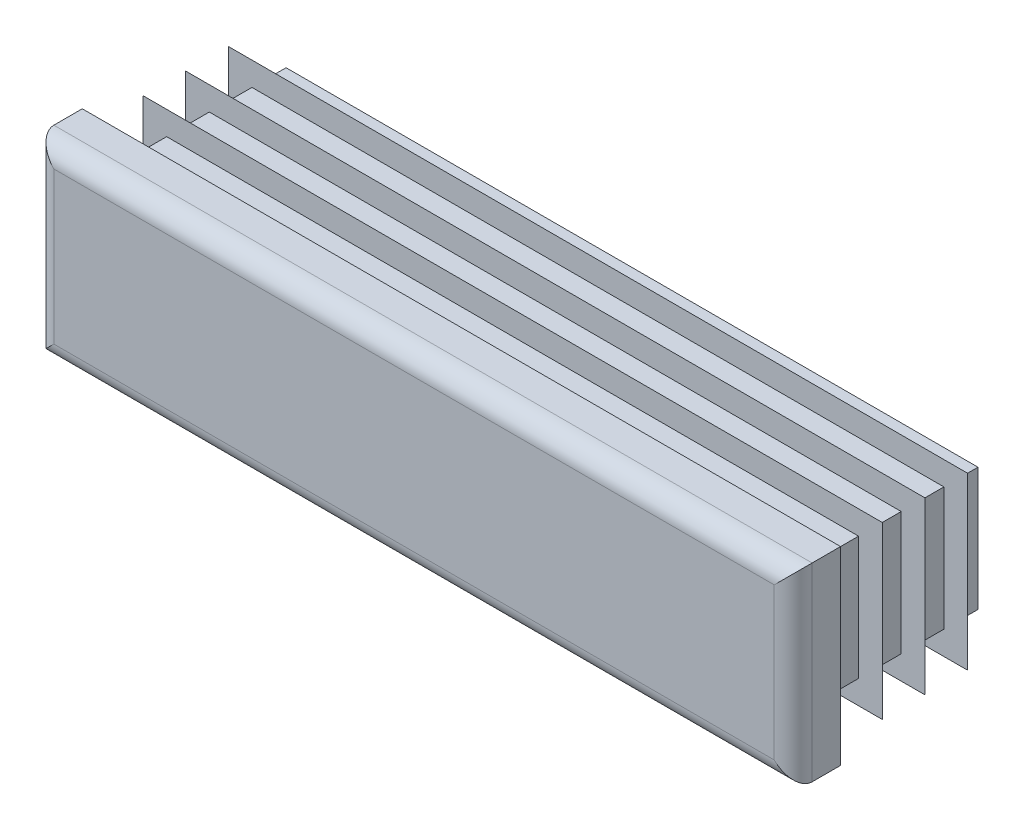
ISO-10303-21;
HEADER;
FILE_DESCRIPTION(('STEP AP214'),'2;1');
FILE_NAME('part.step','',(''),(''),'','','');
FILE_SCHEMA(('AUTOMOTIVE_DESIGN { 1 0 10303 214 1 1 1 1 }'));
ENDSEC;
DATA;
#1=APPLICATION_CONTEXT('core data for automotive mechanical design processes');
#2=APPLICATION_PROTOCOL_DEFINITION('international standard','automotive_design',2000,#1);
#3=PRODUCT_CONTEXT('',#1,'mechanical');
#4=PRODUCT('Part','Part','',(#3));
#5=PRODUCT_RELATED_PRODUCT_CATEGORY('part','',(#4));
#6=PRODUCT_DEFINITION_FORMATION('','',#4);
#7=PRODUCT_DEFINITION_CONTEXT('part definition',#1,'design');
#8=PRODUCT_DEFINITION('design','',#6,#7);
#9=PRODUCT_DEFINITION_SHAPE('','',#8);
#10=(LENGTH_UNIT() NAMED_UNIT(*) SI_UNIT(.MILLI.,.METRE.));
#11=(NAMED_UNIT(*) PLANE_ANGLE_UNIT() SI_UNIT($,.RADIAN.));
#12=(NAMED_UNIT(*) SI_UNIT($,.STERADIAN.) SOLID_ANGLE_UNIT());
#13=UNCERTAINTY_MEASURE_WITH_UNIT(LENGTH_MEASURE(1.E-05),#10,'distance_accuracy_value','');
#14=(GEOMETRIC_REPRESENTATION_CONTEXT(3) GLOBAL_UNCERTAINTY_ASSIGNED_CONTEXT((#13)) GLOBAL_UNIT_ASSIGNED_CONTEXT((#10,
#11,#12)) REPRESENTATION_CONTEXT('',''));
#15=CARTESIAN_POINT('',(0.,0.,0.));
#16=DIRECTION('',(0.,0.,1.));
#17=DIRECTION('',(1.,0.,0.));
#18=AXIS2_PLACEMENT_3D('',#15,#16,#17);
#19=CARTESIAN_POINT('',(38.,-10.,5.));
#20=DIRECTION('',(0.,0.,-1.));
#21=DIRECTION('',(0.,1.,0.));
#22=AXIS2_PLACEMENT_3D('',#19,#20,#21);
#23=PLANE('',#22);
#24=DIRECTION('',(0.,1.,0.));
#25=VECTOR('',#24,1.);
#26=CARTESIAN_POINT('',(-38.,-10.,5.));
#27=LINE('',#26,#25);
#28=CARTESIAN_POINT('',(-38.,-8.,5.));
#29=VERTEX_POINT('',#28);
#30=CARTESIAN_POINT('',(-38.,8.,5.));
#31=VERTEX_POINT('',#30);
#32=EDGE_CURVE('E310',#29,#31,#27,.T.);
#33=ORIENTED_EDGE('',*,*,#32,.F.);
#34=DIRECTION('',(-1.,0.,0.));
#35=VECTOR('',#34,1.);
#36=CARTESIAN_POINT('',(40.,-8.,5.));
#37=LINE('',#36,#35);
#38=CARTESIAN_POINT('',(38.,-8.,5.));
#39=VERTEX_POINT('',#38);
#40=EDGE_CURVE('E482',#39,#29,#37,.T.);
#41=ORIENTED_EDGE('',*,*,#40,.F.);
#42=DIRECTION('',(0.,1.,0.));
#43=VECTOR('',#42,1.);
#44=CARTESIAN_POINT('',(38.,-10.,5.));
#45=LINE('',#44,#43);
#46=CARTESIAN_POINT('',(38.,8.,5.));
#47=VERTEX_POINT('',#46);
#48=EDGE_CURVE('E305',#39,#47,#45,.T.);
#49=ORIENTED_EDGE('',*,*,#48,.T.);
#50=DIRECTION('',(-1.,0.,0.));
#51=VECTOR('',#50,1.);
#52=CARTESIAN_POINT('',(40.,8.,5.));
#53=LINE('',#52,#51);
#54=EDGE_CURVE('E630',#47,#31,#53,.T.);
#55=ORIENTED_EDGE('',*,*,#54,.T.);
#56=EDGE_LOOP('',(#33,#41,#49,#55));
#57=FACE_BOUND('',#56,.T.);
#58=ADVANCED_FACE('F14',(#57),#23,.F.);
#59=CARTESIAN_POINT('',(-38.,-10.,3.));
#60=DIRECTION('',(0.,1.,0.));
#61=DIRECTION('',(-1.,0.,0.));
#62=AXIS2_PLACEMENT_3D('',#59,#60,#61);
#63=CYLINDRICAL_SURFACE('',#62,2.);
#64=DIRECTION('',(0.,1.,0.));
#65=VECTOR('',#64,1.);
#66=CARTESIAN_POINT('',(-40.,-10.,3.));
#67=LINE('',#66,#65);
#68=CARTESIAN_POINT('',(-40.,-10.,3.));
#69=VERTEX_POINT('',#68);
#70=CARTESIAN_POINT('',(-40.,10.,3.));
#71=VERTEX_POINT('',#70);
#72=EDGE_CURVE('E402',#69,#71,#67,.T.);
#73=ORIENTED_EDGE('',*,*,#72,.F.);
#74=CARTESIAN_POINT('',(-38.,-8.,3.));
#75=DIRECTION('',(-0.707106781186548,0.707106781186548,0.));
#76=DIRECTION('',(0.707106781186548,0.707106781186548,0.));
#77=AXIS2_PLACEMENT_3D('',#74,#75,#76);
#78=ELLIPSE('',#77,2.82842712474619,2.);
#79=EDGE_CURVE('E59',#69,#29,#78,.T.);
#80=ORIENTED_EDGE('',*,*,#79,.T.);
#81=ORIENTED_EDGE('',*,*,#32,.T.);
#82=CARTESIAN_POINT('',(-38.,8.,3.));
#83=DIRECTION('',(0.707106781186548,0.707106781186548,0.));
#84=DIRECTION('',(-0.707106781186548,0.707106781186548,0.));
#85=AXIS2_PLACEMENT_3D('',#82,#83,#84);
#86=ELLIPSE('',#85,2.82842712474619,2.);
#87=EDGE_CURVE('E306',#31,#71,#86,.F.);
#88=ORIENTED_EDGE('',*,*,#87,.T.);
#89=EDGE_LOOP('',(#73,#80,#81,#88));
#90=FACE_BOUND('',#89,.T.);
#91=ADVANCED_FACE('F16',(#90),#63,.T.);
#92=CARTESIAN_POINT('',(-40.,-10.,3.));
#93=DIRECTION('',(1.,0.,0.));
#94=DIRECTION('',(0.,1.,0.));
#95=AXIS2_PLACEMENT_3D('',#92,#93,#94);
#96=PLANE('',#95);
#97=DIRECTION('',(0.,0.,-1.));
#98=VECTOR('',#97,1.);
#99=CARTESIAN_POINT('',(-40.,10.,3.));
#100=LINE('',#99,#98);
#101=CARTESIAN_POINT('',(-40.,10.,0.));
#102=VERTEX_POINT('',#101);
#103=EDGE_CURVE('E615',#71,#102,#100,.T.);
#104=ORIENTED_EDGE('',*,*,#103,.T.);
#105=DIRECTION('',(0.,1.,0.));
#106=VECTOR('',#105,1.);
#107=CARTESIAN_POINT('',(-40.,-10.,0.));
#108=LINE('',#107,#106);
#109=CARTESIAN_POINT('',(-40.,-10.,0.));
#110=VERTEX_POINT('',#109);
#111=EDGE_CURVE('E400',#110,#102,#108,.T.);
#112=ORIENTED_EDGE('',*,*,#111,.F.);
#113=DIRECTION('',(0.,0.,-1.));
#114=VECTOR('',#113,1.);
#115=CARTESIAN_POINT('',(-40.,-10.,3.));
#116=LINE('',#115,#114);
#117=EDGE_CURVE('E616',#69,#110,#116,.T.);
#118=ORIENTED_EDGE('',*,*,#117,.F.);
#119=ORIENTED_EDGE('',*,*,#72,.T.);
#120=EDGE_LOOP('',(#104,#112,#118,#119));
#121=FACE_BOUND('',#120,.T.);
#122=ADVANCED_FACE('F697',(#121),#96,.F.);
#123=CARTESIAN_POINT('',(-36.5,-10.,0.));
#124=DIRECTION('',(1.,0.,0.));
#125=DIRECTION('',(0.,1.,0.));
#126=AXIS2_PLACEMENT_3D('',#123,#124,#125);
#127=PLANE('',#126);
#128=DIRECTION('',(0.,1.,0.));
#129=VECTOR('',#128,1.);
#130=CARTESIAN_POINT('',(-36.5,-10.,0.));
#131=LINE('',#130,#129);
#132=CARTESIAN_POINT('',(-36.5,-6.5,0.));
#133=VERTEX_POINT('',#132);
#134=CARTESIAN_POINT('',(-36.5,6.5,0.));
#135=VERTEX_POINT('',#134);
#136=EDGE_CURVE('E397',#133,#135,#131,.T.);
#137=ORIENTED_EDGE('',*,*,#136,.T.);
#138=DIRECTION('',(0.,0.,-1.));
#139=VECTOR('',#138,1.);
#140=CARTESIAN_POINT('',(-36.5,6.5,0.));
#141=LINE('',#140,#139);
#142=CARTESIAN_POINT('',(-36.5,6.5,-0.9));
#143=VERTEX_POINT('',#142);
#144=EDGE_CURVE('E495',#135,#143,#141,.T.);
#145=ORIENTED_EDGE('',*,*,#144,.T.);
#146=DIRECTION('',(0.,1.,0.));
#147=VECTOR('',#146,1.);
#148=CARTESIAN_POINT('',(-36.5,-10.,-0.9));
#149=LINE('',#148,#147);
#150=CARTESIAN_POINT('',(-36.5,-6.5,-0.9));
#151=VERTEX_POINT('',#150);
#152=EDGE_CURVE('E394',#151,#143,#149,.T.);
#153=ORIENTED_EDGE('',*,*,#152,.F.);
#154=DIRECTION('',(0.,0.,1.));
#155=VECTOR('',#154,1.);
#156=CARTESIAN_POINT('',(-36.5,-6.5,0.));
#157=LINE('',#156,#155);
#158=EDGE_CURVE('E489',#151,#133,#157,.T.);
#159=ORIENTED_EDGE('',*,*,#158,.T.);
#160=EDGE_LOOP('',(#137,#145,#153,#159));
#161=FACE_BOUND('',#160,.T.);
#162=ADVANCED_FACE('F787',(#161),#127,.F.);
#163=CARTESIAN_POINT('',(-39.,-10.,-0.9));
#164=DIRECTION('',(0.342020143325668,0.,0.939692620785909));
#165=DIRECTION('',(-0.939692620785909,0.,0.342020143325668));
#166=AXIS2_PLACEMENT_3D('',#163,#164,#165);
#167=PLANE('',#166);
#168=DIRECTION('',(0.,1.,0.));
#169=VECTOR('',#168,1.);
#170=CARTESIAN_POINT('',(-39.,-10.,-0.9));
#171=LINE('',#170,#169);
#172=CARTESIAN_POINT('',(-39.,-9.,-0.9));
#173=VERTEX_POINT('',#172);
#174=CARTESIAN_POINT('',(-39.,9.,-0.9));
#175=VERTEX_POINT('',#174);
#176=EDGE_CURVE('E392',#173,#175,#171,.T.);
#177=ORIENTED_EDGE('',*,*,#176,.T.);
#178=DIRECTION('',(0.844349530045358,-0.43889572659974,-0.307318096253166));
#179=VECTOR('',#178,1.);
#180=CARTESIAN_POINT('',(-31.9589533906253,5.34004028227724,-3.46273138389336));
#181=LINE('',#180,#179);
#182=CARTESIAN_POINT('',(-36.5,7.70049158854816,-1.8099255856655));
#183=VERTEX_POINT('',#182);
#184=EDGE_CURVE('E519',#175,#183,#181,.T.);
#185=ORIENTED_EDGE('',*,*,#184,.T.);
#186=DIRECTION('',(0.,1.,0.));
#187=VECTOR('',#186,1.);
#188=CARTESIAN_POINT('',(-36.5,-10.,-1.8099255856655));
#189=LINE('',#188,#187);
#190=CARTESIAN_POINT('',(-36.5,-7.70049158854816,-1.8099255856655));
#191=VERTEX_POINT('',#190);
#192=EDGE_CURVE('E389',#191,#183,#189,.T.);
#193=ORIENTED_EDGE('',*,*,#192,.F.);
#194=DIRECTION('',(-0.844349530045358,-0.43889572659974,0.307318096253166));
#195=VECTOR('',#194,1.);
#196=CARTESIAN_POINT('',(-39.3705814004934,-9.19262945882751,-0.765119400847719));
#197=LINE('',#196,#195);
#198=EDGE_CURVE('E507',#191,#173,#197,.T.);
#199=ORIENTED_EDGE('',*,*,#198,.T.);
#200=EDGE_LOOP('',(#177,#185,#193,#199));
#201=FACE_BOUND('',#200,.T.);
#202=ADVANCED_FACE('F783',(#201),#167,.F.);
#203=CARTESIAN_POINT('',(-36.5,-10.,-1.8099255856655));
#204=DIRECTION('',(1.,0.,0.));
#205=DIRECTION('',(0.,1.,0.));
#206=AXIS2_PLACEMENT_3D('',#203,#204,#205);
#207=PLANE('',#206);
#208=ORIENTED_EDGE('',*,*,#192,.T.);
#209=DIRECTION('',(0.,-0.819152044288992,-0.573576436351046));
#210=VECTOR('',#209,1.);
#211=CARTESIAN_POINT('',(-36.5,-4.17671654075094,-10.1264362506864));
#212=LINE('',#211,#210);
#213=CARTESIAN_POINT('',(-36.5,6.5,-2.65051884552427));
#214=VERTEX_POINT('',#213);
#215=EDGE_CURVE('E516',#183,#214,#212,.T.);
#216=ORIENTED_EDGE('',*,*,#215,.T.);
#217=DIRECTION('',(0.,0.,-1.));
#218=VECTOR('',#217,1.);
#219=CARTESIAN_POINT('',(-36.5,6.5,-1.8099255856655));
#220=LINE('',#219,#218);
#221=CARTESIAN_POINT('',(-36.5,6.5,-5.4));
#222=VERTEX_POINT('',#221);
#223=EDGE_CURVE('E525',#214,#222,#220,.T.);
#224=ORIENTED_EDGE('',*,*,#223,.T.);
#225=DIRECTION('',(0.,1.,0.));
#226=VECTOR('',#225,1.);
#227=CARTESIAN_POINT('',(-36.5,-10.,-5.4));
#228=LINE('',#227,#226);
#229=CARTESIAN_POINT('',(-36.5,-6.5,-5.4));
#230=VERTEX_POINT('',#229);
#231=EDGE_CURVE('E386',#230,#222,#228,.T.);
#232=ORIENTED_EDGE('',*,*,#231,.F.);
#233=DIRECTION('',(0.,0.,1.));
#234=VECTOR('',#233,1.);
#235=CARTESIAN_POINT('',(-36.5,-6.5,-1.8099255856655));
#236=LINE('',#235,#234);
#237=CARTESIAN_POINT('',(-36.5,-6.5,-2.65051884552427));
#238=VERTEX_POINT('',#237);
#239=EDGE_CURVE('E522',#230,#238,#236,.T.);
#240=ORIENTED_EDGE('',*,*,#239,.T.);
#241=DIRECTION('',(0.,-0.819152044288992,0.573576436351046));
#242=VECTOR('',#241,1.);
#243=CARTESIAN_POINT('',(-36.5,-9.24348489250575,-0.729510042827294));
#244=LINE('',#243,#242);
#245=EDGE_CURVE('E504',#238,#191,#244,.T.);
#246=ORIENTED_EDGE('',*,*,#245,.T.);
#247=EDGE_LOOP('',(#208,#216,#224,#232,#240,#246));
#248=FACE_BOUND('',#247,.T.);
#249=ADVANCED_FACE('F779',(#248),#207,.F.);
#250=CARTESIAN_POINT('',(-39.,-10.,-5.4));
#251=DIRECTION('',(0.342020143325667,0.,0.939692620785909));
#252=DIRECTION('',(-0.939692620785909,0.,0.342020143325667));
#253=AXIS2_PLACEMENT_3D('',#250,#251,#252);
#254=PLANE('',#253);
#255=DIRECTION('',(0.,1.,0.));
#256=VECTOR('',#255,1.);
#257=CARTESIAN_POINT('',(-39.,-10.,-5.4));
#258=LINE('',#257,#256);
#259=CARTESIAN_POINT('',(-39.,-9.,-5.4));
#260=VERTEX_POINT('',#259);
#261=CARTESIAN_POINT('',(-39.,9.,-5.4));
#262=VERTEX_POINT('',#261);
#263=EDGE_CURVE('E384',#260,#262,#258,.T.);
#264=ORIENTED_EDGE('',*,*,#263,.T.);
#265=DIRECTION('',(0.844349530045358,-0.43889572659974,-0.307318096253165));
#266=VECTOR('',#265,1.);
#267=CARTESIAN_POINT('',(-31.9589533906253,5.34004028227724,-7.96273138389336));
#268=LINE('',#267,#266);
#269=CARTESIAN_POINT('',(-36.5,7.70049158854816,-6.30992558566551));
#270=VERTEX_POINT('',#269);
#271=EDGE_CURVE('E549',#262,#270,#268,.T.);
#272=ORIENTED_EDGE('',*,*,#271,.T.);
#273=DIRECTION('',(0.,1.,0.));
#274=VECTOR('',#273,1.);
#275=CARTESIAN_POINT('',(-36.5,-10.,-6.3099255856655));
#276=LINE('',#275,#274);
#277=CARTESIAN_POINT('',(-36.5,-7.70049158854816,-6.3099255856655));
#278=VERTEX_POINT('',#277);
#279=EDGE_CURVE('E381',#278,#270,#276,.T.);
#280=ORIENTED_EDGE('',*,*,#279,.F.);
#281=DIRECTION('',(-0.844349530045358,-0.43889572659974,0.307318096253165));
#282=VECTOR('',#281,1.);
#283=CARTESIAN_POINT('',(-39.3705814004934,-9.19262945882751,-5.26511940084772));
#284=LINE('',#283,#282);
#285=EDGE_CURVE('E537',#278,#260,#284,.T.);
#286=ORIENTED_EDGE('',*,*,#285,.T.);
#287=EDGE_LOOP('',(#264,#272,#280,#286));
#288=FACE_BOUND('',#287,.T.);
#289=ADVANCED_FACE('F775',(#288),#254,.F.);
#290=CARTESIAN_POINT('',(-36.5,-10.,-6.3099255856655));
#291=DIRECTION('',(1.,0.,0.));
#292=DIRECTION('',(0.,1.,0.));
#293=AXIS2_PLACEMENT_3D('',#290,#291,#292);
#294=PLANE('',#293);
#295=ORIENTED_EDGE('',*,*,#279,.T.);
#296=DIRECTION('',(0.,-0.819152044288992,-0.573576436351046));
#297=VECTOR('',#296,1.);
#298=CARTESIAN_POINT('',(-36.5,-4.17671654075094,-14.6264362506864));
#299=LINE('',#298,#297);
#300=CARTESIAN_POINT('',(-36.5,6.5,-7.15051884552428));
#301=VERTEX_POINT('',#300);
#302=EDGE_CURVE('E546',#270,#301,#299,.T.);
#303=ORIENTED_EDGE('',*,*,#302,.T.);
#304=DIRECTION('',(0.,0.,-1.));
#305=VECTOR('',#304,1.);
#306=CARTESIAN_POINT('',(-36.5,6.5,-6.3099255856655));
#307=LINE('',#306,#305);
#308=CARTESIAN_POINT('',(-36.5,6.5,-9.9));
#309=VERTEX_POINT('',#308);
#310=EDGE_CURVE('E555',#301,#309,#307,.T.);
#311=ORIENTED_EDGE('',*,*,#310,.T.);
#312=DIRECTION('',(0.,1.,0.));
#313=VECTOR('',#312,1.);
#314=CARTESIAN_POINT('',(-36.5,-10.,-9.9));
#315=LINE('',#314,#313);
#316=CARTESIAN_POINT('',(-36.5,-6.5,-9.9));
#317=VERTEX_POINT('',#316);
#318=EDGE_CURVE('E378',#317,#309,#315,.T.);
#319=ORIENTED_EDGE('',*,*,#318,.F.);
#320=DIRECTION('',(0.,0.,1.));
#321=VECTOR('',#320,1.);
#322=CARTESIAN_POINT('',(-36.5,-6.5,-6.3099255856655));
#323=LINE('',#322,#321);
#324=CARTESIAN_POINT('',(-36.5,-6.5,-7.15051884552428));
#325=VERTEX_POINT('',#324);
#326=EDGE_CURVE('E552',#317,#325,#323,.T.);
#327=ORIENTED_EDGE('',*,*,#326,.T.);
#328=DIRECTION('',(0.,-0.819152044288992,0.573576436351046));
#329=VECTOR('',#328,1.);
#330=CARTESIAN_POINT('',(-36.5,-9.24348489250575,-5.22951004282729));
#331=LINE('',#330,#329);
#332=EDGE_CURVE('E534',#325,#278,#331,.T.);
#333=ORIENTED_EDGE('',*,*,#332,.T.);
#334=EDGE_LOOP('',(#295,#303,#311,#319,#327,#333));
#335=FACE_BOUND('',#334,.T.);
#336=ADVANCED_FACE('F771',(#335),#294,.F.);
#337=CARTESIAN_POINT('',(-39.,-10.,-9.9));
#338=DIRECTION('',(0.342020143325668,0.,0.939692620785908));
#339=DIRECTION('',(-0.939692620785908,0.,0.342020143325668));
#340=AXIS2_PLACEMENT_3D('',#337,#338,#339);
#341=PLANE('',#340);
#342=DIRECTION('',(0.,1.,0.));
#343=VECTOR('',#342,1.);
#344=CARTESIAN_POINT('',(-39.,-10.,-9.9));
#345=LINE('',#344,#343);
#346=CARTESIAN_POINT('',(-39.,-9.,-9.9));
#347=VERTEX_POINT('',#346);
#348=CARTESIAN_POINT('',(-39.,9.,-9.9));
#349=VERTEX_POINT('',#348);
#350=EDGE_CURVE('E376',#347,#349,#345,.T.);
#351=ORIENTED_EDGE('',*,*,#350,.T.);
#352=DIRECTION('',(0.844349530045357,-0.438895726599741,-0.307318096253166));
#353=VECTOR('',#352,1.);
#354=CARTESIAN_POINT('',(-31.9589533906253,5.34004028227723,-12.4627313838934));
#355=LINE('',#354,#353);
#356=CARTESIAN_POINT('',(-36.5,7.70049158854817,-10.8099255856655));
#357=VERTEX_POINT('',#356);
#358=EDGE_CURVE('E579',#349,#357,#355,.T.);
#359=ORIENTED_EDGE('',*,*,#358,.T.);
#360=DIRECTION('',(0.,1.,0.));
#361=VECTOR('',#360,1.);
#362=CARTESIAN_POINT('',(-36.5,-10.,-10.8099255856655));
#363=LINE('',#362,#361);
#364=CARTESIAN_POINT('',(-36.5,-7.70049158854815,-10.8099255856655));
#365=VERTEX_POINT('',#364);
#366=EDGE_CURVE('E373',#365,#357,#363,.T.);
#367=ORIENTED_EDGE('',*,*,#366,.F.);
#368=DIRECTION('',(-0.844349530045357,-0.438895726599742,0.307318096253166));
#369=VECTOR('',#368,1.);
#370=CARTESIAN_POINT('',(-39.3705814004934,-9.19262945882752,-9.76511940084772));
#371=LINE('',#370,#369);
#372=EDGE_CURVE('E567',#365,#347,#371,.T.);
#373=ORIENTED_EDGE('',*,*,#372,.T.);
#374=EDGE_LOOP('',(#351,#359,#367,#373));
#375=FACE_BOUND('',#374,.T.);
#376=ADVANCED_FACE('F767',(#375),#341,.F.);
#377=CARTESIAN_POINT('',(-36.5,-10.,-10.8099255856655));
#378=DIRECTION('',(1.,0.,0.));
#379=DIRECTION('',(0.,1.,0.));
#380=AXIS2_PLACEMENT_3D('',#377,#378,#379);
#381=PLANE('',#380);
#382=ORIENTED_EDGE('',*,*,#366,.T.);
#383=DIRECTION('',(0.,-0.819152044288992,-0.573576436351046));
#384=VECTOR('',#383,1.);
#385=CARTESIAN_POINT('',(-36.5,-4.17671654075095,-19.1264362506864));
#386=LINE('',#385,#384);
#387=CARTESIAN_POINT('',(-36.5,6.5,-11.6505188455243));
#388=VERTEX_POINT('',#387);
#389=EDGE_CURVE('E576',#357,#388,#386,.T.);
#390=ORIENTED_EDGE('',*,*,#389,.T.);
#391=DIRECTION('',(0.,0.,-1.));
#392=VECTOR('',#391,1.);
#393=CARTESIAN_POINT('',(-36.5,6.5,-10.8099255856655));
#394=LINE('',#393,#392);
#395=CARTESIAN_POINT('',(-36.5,6.5,-14.4));
#396=VERTEX_POINT('',#395);
#397=EDGE_CURVE('E585',#388,#396,#394,.T.);
#398=ORIENTED_EDGE('',*,*,#397,.T.);
#399=DIRECTION('',(0.,1.,0.));
#400=VECTOR('',#399,1.);
#401=CARTESIAN_POINT('',(-36.5,-10.,-14.4));
#402=LINE('',#401,#400);
#403=CARTESIAN_POINT('',(-36.5,-6.5,-14.4));
#404=VERTEX_POINT('',#403);
#405=EDGE_CURVE('E370',#404,#396,#402,.T.);
#406=ORIENTED_EDGE('',*,*,#405,.F.);
#407=DIRECTION('',(0.,0.,1.));
#408=VECTOR('',#407,1.);
#409=CARTESIAN_POINT('',(-36.5,-6.5,-10.8099255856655));
#410=LINE('',#409,#408);
#411=CARTESIAN_POINT('',(-36.5,-6.5,-11.6505188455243));
#412=VERTEX_POINT('',#411);
#413=EDGE_CURVE('E582',#404,#412,#410,.T.);
#414=ORIENTED_EDGE('',*,*,#413,.T.);
#415=DIRECTION('',(0.,-0.819152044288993,0.573576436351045));
#416=VECTOR('',#415,1.);
#417=CARTESIAN_POINT('',(-36.5,-9.24348489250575,-9.72951004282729));
#418=LINE('',#417,#416);
#419=EDGE_CURVE('E564',#412,#365,#418,.T.);
#420=ORIENTED_EDGE('',*,*,#419,.T.);
#421=EDGE_LOOP('',(#382,#390,#398,#406,#414,#420));
#422=FACE_BOUND('',#421,.T.);
#423=ADVANCED_FACE('F764',(#422),#381,.F.);
#424=CARTESIAN_POINT('',(-39.,-10.,-14.4));
#425=DIRECTION('',(0.342020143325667,0.,0.939692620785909));
#426=DIRECTION('',(-0.939692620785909,0.,0.342020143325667));
#427=AXIS2_PLACEMENT_3D('',#424,#425,#426);
#428=PLANE('',#427);
#429=DIRECTION('',(0.,1.,0.));
#430=VECTOR('',#429,1.);
#431=CARTESIAN_POINT('',(-39.,-10.,-14.4));
#432=LINE('',#431,#430);
#433=CARTESIAN_POINT('',(-39.,-9.,-14.4));
#434=VERTEX_POINT('',#433);
#435=CARTESIAN_POINT('',(-39.,9.,-14.4));
#436=VERTEX_POINT('',#435);
#437=EDGE_CURVE('E368',#434,#436,#432,.T.);
#438=ORIENTED_EDGE('',*,*,#437,.T.);
#439=DIRECTION('',(0.844349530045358,-0.438895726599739,-0.307318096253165));
#440=VECTOR('',#439,1.);
#441=CARTESIAN_POINT('',(-31.9589533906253,5.34004028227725,-16.9627313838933));
#442=LINE('',#441,#440);
#443=CARTESIAN_POINT('',(-36.5,7.70049158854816,-15.3099255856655));
#444=VERTEX_POINT('',#443);
#445=EDGE_CURVE('E607',#436,#444,#442,.T.);
#446=ORIENTED_EDGE('',*,*,#445,.T.);
#447=DIRECTION('',(0.,1.,0.));
#448=VECTOR('',#447,1.);
#449=CARTESIAN_POINT('',(-36.5,-10.,-15.3099255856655));
#450=LINE('',#449,#448);
#451=CARTESIAN_POINT('',(-36.5,-7.70049158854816,-15.3099255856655));
#452=VERTEX_POINT('',#451);
#453=EDGE_CURVE('E365',#452,#444,#450,.T.);
#454=ORIENTED_EDGE('',*,*,#453,.F.);
#455=DIRECTION('',(-0.844349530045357,-0.438895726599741,0.307318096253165));
#456=VECTOR('',#455,1.);
#457=CARTESIAN_POINT('',(-39.3705814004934,-9.19262945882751,-14.2651194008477));
#458=LINE('',#457,#456);
#459=EDGE_CURVE('E595',#452,#434,#458,.T.);
#460=ORIENTED_EDGE('',*,*,#459,.T.);
#461=EDGE_LOOP('',(#438,#446,#454,#460));
#462=FACE_BOUND('',#461,.T.);
#463=ADVANCED_FACE('F675',(#462),#428,.F.);
#464=CARTESIAN_POINT('',(-36.5,-10.,-15.3099255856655));
#465=DIRECTION('',(1.,0.,0.));
#466=DIRECTION('',(0.,1.,0.));
#467=AXIS2_PLACEMENT_3D('',#464,#465,#466);
#468=PLANE('',#467);
#469=ORIENTED_EDGE('',*,*,#453,.T.);
#470=DIRECTION('',(0.,-0.819152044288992,-0.573576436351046));
#471=VECTOR('',#470,1.);
#472=CARTESIAN_POINT('',(-36.5,-4.17671654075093,-23.6264362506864));
#473=LINE('',#472,#471);
#474=CARTESIAN_POINT('',(-36.5,6.5,-16.1505188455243));
#475=VERTEX_POINT('',#474);
#476=EDGE_CURVE('E604',#444,#475,#473,.T.);
#477=ORIENTED_EDGE('',*,*,#476,.T.);
#478=DIRECTION('',(0.,0.,-1.));
#479=VECTOR('',#478,1.);
#480=CARTESIAN_POINT('',(-36.5,6.5,-15.3099255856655));
#481=LINE('',#480,#479);
#482=CARTESIAN_POINT('',(-36.5,6.5,-18.));
#483=VERTEX_POINT('',#482);
#484=EDGE_CURVE('E613',#475,#483,#481,.T.);
#485=ORIENTED_EDGE('',*,*,#484,.T.);
#486=DIRECTION('',(0.,1.,0.));
#487=VECTOR('',#486,1.);
#488=CARTESIAN_POINT('',(-36.5,-10.,-18.));
#489=LINE('',#488,#487);
#490=CARTESIAN_POINT('',(-36.5,-6.5,-18.));
#491=VERTEX_POINT('',#490);
#492=EDGE_CURVE('E362',#491,#483,#489,.T.);
#493=ORIENTED_EDGE('',*,*,#492,.F.);
#494=DIRECTION('',(0.,0.,1.));
#495=VECTOR('',#494,1.);
#496=CARTESIAN_POINT('',(-36.5,-6.5,-15.3099255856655));
#497=LINE('',#496,#495);
#498=CARTESIAN_POINT('',(-36.5,-6.5,-16.1505188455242));
#499=VERTEX_POINT('',#498);
#500=EDGE_CURVE('E610',#491,#499,#497,.T.);
#501=ORIENTED_EDGE('',*,*,#500,.T.);
#502=DIRECTION('',(0.,-0.819152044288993,0.573576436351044));
#503=VECTOR('',#502,1.);
#504=CARTESIAN_POINT('',(-36.5,-9.24348489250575,-14.2295100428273));
#505=LINE('',#504,#503);
#506=EDGE_CURVE('E592',#499,#452,#505,.T.);
#507=ORIENTED_EDGE('',*,*,#506,.T.);
#508=EDGE_LOOP('',(#469,#477,#485,#493,#501,#507));
#509=FACE_BOUND('',#508,.T.);
#510=ADVANCED_FACE('F677',(#509),#468,.F.);
#511=CARTESIAN_POINT('',(-36.5,-10.,-18.));
#512=DIRECTION('',(0.,0.,1.));
#513=DIRECTION('',(0.,-1.,0.));
#514=AXIS2_PLACEMENT_3D('',#511,#512,#513);
#515=PLANE('',#514);
#516=ORIENTED_EDGE('',*,*,#492,.T.);
#517=DIRECTION('',(-1.,0.,0.));
#518=VECTOR('',#517,1.);
#519=CARTESIAN_POINT('',(40.,6.5,-18.));
#520=LINE('',#519,#518);
#521=CARTESIAN_POINT('',(36.5,6.5,-18.));
#522=VERTEX_POINT('',#521);
#523=EDGE_CURVE('E438',#522,#483,#520,.T.);
#524=ORIENTED_EDGE('',*,*,#523,.F.);
#525=DIRECTION('',(0.,1.,0.));
#526=VECTOR('',#525,1.);
#527=CARTESIAN_POINT('',(36.5,-10.,-18.));
#528=LINE('',#527,#526);
#529=CARTESIAN_POINT('',(36.5,-6.5,-18.));
#530=VERTEX_POINT('',#529);
#531=EDGE_CURVE('E359',#530,#522,#528,.T.);
#532=ORIENTED_EDGE('',*,*,#531,.F.);
#533=DIRECTION('',(-1.,0.,0.));
#534=VECTOR('',#533,1.);
#535=CARTESIAN_POINT('',(40.,-6.5,-18.));
#536=LINE('',#535,#534);
#537=EDGE_CURVE('E436',#530,#491,#536,.T.);
#538=ORIENTED_EDGE('',*,*,#537,.T.);
#539=EDGE_LOOP('',(#516,#524,#532,#538));
#540=FACE_BOUND('',#539,.T.);
#541=ADVANCED_FACE('F435',(#540),#515,.F.);
#542=CARTESIAN_POINT('',(36.5,-10.,-18.));
#543=DIRECTION('',(-1.,0.,0.));
#544=DIRECTION('',(0.,-1.,0.));
#545=AXIS2_PLACEMENT_3D('',#542,#543,#544);
#546=PLANE('',#545);
#547=DIRECTION('',(0.,0.,1.));
#548=VECTOR('',#547,1.);
#549=CARTESIAN_POINT('',(36.5,6.5,-18.));
#550=LINE('',#549,#548);
#551=CARTESIAN_POINT('',(36.5,6.5,-16.1505188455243));
#552=VERTEX_POINT('',#551);
#553=EDGE_CURVE('E9',#522,#552,#550,.T.);
#554=ORIENTED_EDGE('',*,*,#553,.T.);
#555=DIRECTION('',(0.,0.819152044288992,0.573576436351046));
#556=VECTOR('',#555,1.);
#557=CARTESIAN_POINT('',(36.5,-5.44063807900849,-24.5114436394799));
#558=LINE('',#557,#556);
#559=CARTESIAN_POINT('',(36.5,7.70049158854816,-15.3099255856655));
#560=VERTEX_POINT('',#559);
#561=EDGE_CURVE('E601',#552,#560,#558,.T.);
#562=ORIENTED_EDGE('',*,*,#561,.T.);
#563=DIRECTION('',(0.,1.,0.));
#564=VECTOR('',#563,1.);
#565=CARTESIAN_POINT('',(36.5,-10.,-15.3099255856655));
#566=LINE('',#565,#564);
#567=CARTESIAN_POINT('',(36.5,-7.70049158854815,-15.3099255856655));
#568=VERTEX_POINT('',#567);
#569=EDGE_CURVE('E356',#568,#560,#566,.T.);
#570=ORIENTED_EDGE('',*,*,#569,.F.);
#571=DIRECTION('',(0.,0.819152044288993,-0.573576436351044));
#572=VECTOR('',#571,1.);
#573=CARTESIAN_POINT('',(36.5,-7.97956335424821,-15.1145174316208));
#574=LINE('',#573,#572);
#575=CARTESIAN_POINT('',(36.5,-6.5,-16.1505188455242));
#576=VERTEX_POINT('',#575);
#577=EDGE_CURVE('E428',#568,#576,#574,.T.);
#578=ORIENTED_EDGE('',*,*,#577,.T.);
#579=DIRECTION('',(0.,0.,-1.));
#580=VECTOR('',#579,1.);
#581=CARTESIAN_POINT('',(36.5,-6.5,-18.));
#582=LINE('',#581,#580);
#583=EDGE_CURVE('E23',#576,#530,#582,.T.);
#584=ORIENTED_EDGE('',*,*,#583,.T.);
#585=ORIENTED_EDGE('',*,*,#531,.T.);
#586=EDGE_LOOP('',(#554,#562,#570,#578,#584,#585));
#587=FACE_BOUND('',#586,.T.);
#588=ADVANCED_FACE('F426',(#587),#546,.F.);
#589=CARTESIAN_POINT('',(36.5,-10.,-15.3099255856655));
#590=DIRECTION('',(-0.342020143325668,0.,0.939692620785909));
#591=DIRECTION('',(-0.939692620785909,0.,-0.342020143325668));
#592=AXIS2_PLACEMENT_3D('',#589,#590,#591);
#593=PLANE('',#592);
#594=ORIENTED_EDGE('',*,*,#569,.T.);
#595=DIRECTION('',(0.844349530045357,0.43889572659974,0.307318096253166));
#596=VECTOR('',#595,1.);
#597=CARTESIAN_POINT('',(29.940527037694,4.29085547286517,-17.6973784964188));
#598=LINE('',#597,#596);
#599=CARTESIAN_POINT('',(39.,9.,-14.4));
#600=VERTEX_POINT('',#599);
#601=EDGE_CURVE('E598',#560,#600,#598,.T.);
#602=ORIENTED_EDGE('',*,*,#601,.T.);
#603=DIRECTION('',(0.,1.,0.));
#604=VECTOR('',#603,1.);
#605=CARTESIAN_POINT('',(39.,-10.,-14.4));
#606=LINE('',#605,#604);
#607=CARTESIAN_POINT('',(39.,-9.,-14.4));
#608=VERTEX_POINT('',#607);
#609=EDGE_CURVE('E353',#608,#600,#606,.T.);
#610=ORIENTED_EDGE('',*,*,#609,.F.);
#611=DIRECTION('',(-0.844349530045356,0.438895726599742,-0.307318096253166));
#612=VECTOR('',#611,1.);
#613=CARTESIAN_POINT('',(37.3521550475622,-8.14344464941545,-14.9997665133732));
#614=LINE('',#613,#612);
#615=EDGE_CURVE('E588',#608,#568,#614,.T.);
#616=ORIENTED_EDGE('',*,*,#615,.T.);
#617=EDGE_LOOP('',(#594,#602,#610,#616));
#618=FACE_BOUND('',#617,.T.);
#619=ADVANCED_FACE('F752',(#618),#593,.F.);
#620=CARTESIAN_POINT('',(39.,-10.,-14.4));
#621=DIRECTION('',(0.,0.,-1.));
#622=DIRECTION('',(0.,1.,0.));
#623=AXIS2_PLACEMENT_3D('',#620,#621,#622);
#624=PLANE('',#623);
#625=ORIENTED_EDGE('',*,*,#609,.T.);
#626=DIRECTION('',(-1.,0.,0.));
#627=VECTOR('',#626,1.);
#628=CARTESIAN_POINT('',(40.,9.,-14.4));
#629=LINE('',#628,#627);
#630=EDGE_CURVE('E444',#600,#436,#629,.T.);
#631=ORIENTED_EDGE('',*,*,#630,.T.);
#632=ORIENTED_EDGE('',*,*,#437,.F.);
#633=DIRECTION('',(-1.,0.,0.));
#634=VECTOR('',#633,1.);
#635=CARTESIAN_POINT('',(40.,-9.,-14.4));
#636=LINE('',#635,#634);
#637=EDGE_CURVE('E451',#608,#434,#636,.T.);
#638=ORIENTED_EDGE('',*,*,#637,.F.);
#639=EDGE_LOOP('',(#625,#631,#632,#638));
#640=FACE_BOUND('',#639,.T.);
#641=ORIENTED_EDGE('',*,*,#405,.T.);
#642=DIRECTION('',(-1.,0.,0.));
#643=VECTOR('',#642,1.);
#644=CARTESIAN_POINT('',(40.,6.5,-14.4));
#645=LINE('',#644,#643);
#646=CARTESIAN_POINT('',(36.5,6.5,-14.4));
#647=VERTEX_POINT('',#646);
#648=EDGE_CURVE('E663',#647,#396,#645,.T.);
#649=ORIENTED_EDGE('',*,*,#648,.F.);
#650=DIRECTION('',(0.,1.,0.));
#651=VECTOR('',#650,1.);
#652=CARTESIAN_POINT('',(36.5,-10.,-14.4));
#653=LINE('',#652,#651);
#654=CARTESIAN_POINT('',(36.5,-6.5,-14.4));
#655=VERTEX_POINT('',#654);
#656=EDGE_CURVE('E350',#655,#647,#653,.T.);
#657=ORIENTED_EDGE('',*,*,#656,.F.);
#658=DIRECTION('',(-1.,0.,0.));
#659=VECTOR('',#658,1.);
#660=CARTESIAN_POINT('',(40.,-6.5,-14.4));
#661=LINE('',#660,#659);
#662=EDGE_CURVE('E453',#655,#404,#661,.T.);
#663=ORIENTED_EDGE('',*,*,#662,.T.);
#664=EDGE_LOOP('',(#641,#649,#657,#663));
#665=FACE_BOUND('',#664,.T.);
#666=ADVANCED_FACE('F667',(#640,#665),#624,.F.);
#667=CARTESIAN_POINT('',(36.5,-10.,-14.4));
#668=DIRECTION('',(-1.,0.,0.));
#669=DIRECTION('',(0.,-1.,0.));
#670=AXIS2_PLACEMENT_3D('',#667,#668,#669);
#671=PLANE('',#670);
#672=DIRECTION('',(0.,0.,1.));
#673=VECTOR('',#672,1.);
#674=CARTESIAN_POINT('',(36.5,6.5,-14.4));
#675=LINE('',#674,#673);
#676=CARTESIAN_POINT('',(36.5,6.5,-11.6505188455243));
#677=VERTEX_POINT('',#676);
#678=EDGE_CURVE('E420',#647,#677,#675,.T.);
#679=ORIENTED_EDGE('',*,*,#678,.T.);
#680=DIRECTION('',(0.,0.819152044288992,0.573576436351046));
#681=VECTOR('',#680,1.);
#682=CARTESIAN_POINT('',(36.5,-5.86349975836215,-20.3075345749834));
#683=LINE('',#682,#681);
#684=CARTESIAN_POINT('',(36.5,7.70049158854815,-10.8099255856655));
#685=VERTEX_POINT('',#684);
#686=EDGE_CURVE('E573',#677,#685,#683,.T.);
#687=ORIENTED_EDGE('',*,*,#686,.T.);
#688=DIRECTION('',(0.,1.,0.));
#689=VECTOR('',#688,1.);
#690=CARTESIAN_POINT('',(36.5,-10.,-10.8099255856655));
#691=LINE('',#690,#689);
#692=CARTESIAN_POINT('',(36.5,-7.70049158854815,-10.8099255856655));
#693=VERTEX_POINT('',#692);
#694=EDGE_CURVE('E347',#693,#685,#691,.T.);
#695=ORIENTED_EDGE('',*,*,#694,.F.);
#696=DIRECTION('',(0.,0.819152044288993,-0.573576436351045));
#697=VECTOR('',#696,1.);
#698=CARTESIAN_POINT('',(36.5,-7.55670167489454,-10.9106083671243));
#699=LINE('',#698,#697);
#700=CARTESIAN_POINT('',(36.5,-6.5,-11.6505188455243));
#701=VERTEX_POINT('',#700);
#702=EDGE_CURVE('E561',#693,#701,#699,.T.);
#703=ORIENTED_EDGE('',*,*,#702,.T.);
#704=DIRECTION('',(0.,0.,-1.));
#705=VECTOR('',#704,1.);
#706=CARTESIAN_POINT('',(36.5,-6.5,-14.4));
#707=LINE('',#706,#705);
#708=EDGE_CURVE('E417',#701,#655,#707,.T.);
#709=ORIENTED_EDGE('',*,*,#708,.T.);
#710=ORIENTED_EDGE('',*,*,#656,.T.);
#711=EDGE_LOOP('',(#679,#687,#695,#703,#709,#710));
#712=FACE_BOUND('',#711,.T.);
#713=ADVANCED_FACE('F745',(#712),#671,.F.);
#714=CARTESIAN_POINT('',(36.5,-10.,-10.8099255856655));
#715=DIRECTION('',(-0.342020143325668,0.,0.939692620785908));
#716=DIRECTION('',(-0.939692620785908,0.,-0.342020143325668));
#717=AXIS2_PLACEMENT_3D('',#714,#715,#716);
#718=PLANE('',#717);
#719=ORIENTED_EDGE('',*,*,#694,.T.);
#720=DIRECTION('',(0.844349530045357,0.438895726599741,0.307318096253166));
#721=VECTOR('',#720,1.);
#722=CARTESIAN_POINT('',(29.940527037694,4.29085547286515,-13.1973784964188));
#723=LINE('',#722,#721);
#724=CARTESIAN_POINT('',(39.,9.,-9.9));
#725=VERTEX_POINT('',#724);
#726=EDGE_CURVE('E570',#685,#725,#723,.T.);
#727=ORIENTED_EDGE('',*,*,#726,.T.);
#728=DIRECTION('',(0.,1.,0.));
#729=VECTOR('',#728,1.);
#730=CARTESIAN_POINT('',(39.,-10.,-9.9));
#731=LINE('',#730,#729);
#732=CARTESIAN_POINT('',(39.,-9.,-9.9));
#733=VERTEX_POINT('',#732);
#734=EDGE_CURVE('E344',#733,#725,#731,.T.);
#735=ORIENTED_EDGE('',*,*,#734,.F.);
#736=DIRECTION('',(-0.844349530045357,0.438895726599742,-0.307318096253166));
#737=VECTOR('',#736,1.);
#738=CARTESIAN_POINT('',(37.3521550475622,-8.14344464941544,-10.4997665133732));
#739=LINE('',#738,#737);
#740=EDGE_CURVE('E558',#733,#693,#739,.T.);
#741=ORIENTED_EDGE('',*,*,#740,.T.);
#742=EDGE_LOOP('',(#719,#727,#735,#741));
#743=FACE_BOUND('',#742,.T.);
#744=ADVANCED_FACE('F741',(#743),#718,.F.);
#745=CARTESIAN_POINT('',(39.,-10.,-9.9));
#746=DIRECTION('',(0.,0.,-1.));
#747=DIRECTION('',(0.,1.,0.));
#748=AXIS2_PLACEMENT_3D('',#745,#746,#747);
#749=PLANE('',#748);
#750=ORIENTED_EDGE('',*,*,#734,.T.);
#751=DIRECTION('',(-1.,0.,0.));
#752=VECTOR('',#751,1.);
#753=CARTESIAN_POINT('',(40.,9.,-9.9));
#754=LINE('',#753,#752);
#755=EDGE_CURVE('E657',#725,#349,#754,.T.);
#756=ORIENTED_EDGE('',*,*,#755,.T.);
#757=ORIENTED_EDGE('',*,*,#350,.F.);
#758=DIRECTION('',(-1.,0.,0.));
#759=VECTOR('',#758,1.);
#760=CARTESIAN_POINT('',(40.,-9.,-9.9));
#761=LINE('',#760,#759);
#762=EDGE_CURVE('E459',#733,#347,#761,.T.);
#763=ORIENTED_EDGE('',*,*,#762,.F.);
#764=EDGE_LOOP('',(#750,#756,#757,#763));
#765=FACE_BOUND('',#764,.T.);
#766=ORIENTED_EDGE('',*,*,#318,.T.);
#767=DIRECTION('',(-1.,0.,0.));
#768=VECTOR('',#767,1.);
#769=CARTESIAN_POINT('',(40.,6.5,-9.9));
#770=LINE('',#769,#768);
#771=CARTESIAN_POINT('',(36.5,6.5,-9.9));
#772=VERTEX_POINT('',#771);
#773=EDGE_CURVE('E655',#772,#309,#770,.T.);
#774=ORIENTED_EDGE('',*,*,#773,.F.);
#775=DIRECTION('',(0.,1.,0.));
#776=VECTOR('',#775,1.);
#777=CARTESIAN_POINT('',(36.5,-10.,-9.9));
#778=LINE('',#777,#776);
#779=CARTESIAN_POINT('',(36.5,-6.5,-9.9));
#780=VERTEX_POINT('',#779);
#781=EDGE_CURVE('E341',#780,#772,#778,.T.);
#782=ORIENTED_EDGE('',*,*,#781,.F.);
#783=DIRECTION('',(-1.,0.,0.));
#784=VECTOR('',#783,1.);
#785=CARTESIAN_POINT('',(40.,-6.5,-9.9));
#786=LINE('',#785,#784);
#787=EDGE_CURVE('E461',#780,#317,#786,.T.);
#788=ORIENTED_EDGE('',*,*,#787,.T.);
#789=EDGE_LOOP('',(#766,#774,#782,#788));
#790=FACE_BOUND('',#789,.T.);
#791=ADVANCED_FACE('F737',(#765,#790),#749,.F.);
#792=CARTESIAN_POINT('',(36.5,-10.,-9.9));
#793=DIRECTION('',(-1.,0.,0.));
#794=DIRECTION('',(0.,-1.,0.));
#795=AXIS2_PLACEMENT_3D('',#792,#793,#794);
#796=PLANE('',#795);
#797=DIRECTION('',(0.,0.,1.));
#798=VECTOR('',#797,1.);
#799=CARTESIAN_POINT('',(36.5,6.5,-9.9));
#800=LINE('',#799,#798);
#801=CARTESIAN_POINT('',(36.5,6.5,-7.15051884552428));
#802=VERTEX_POINT('',#801);
#803=EDGE_CURVE('E414',#772,#802,#800,.T.);
#804=ORIENTED_EDGE('',*,*,#803,.T.);
#805=DIRECTION('',(0.,0.819152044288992,0.573576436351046));
#806=VECTOR('',#805,1.);
#807=CARTESIAN_POINT('',(36.5,-5.86349975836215,-15.8075345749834));
#808=LINE('',#807,#806);
#809=CARTESIAN_POINT('',(36.5,7.70049158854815,-6.30992558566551));
#810=VERTEX_POINT('',#809);
#811=EDGE_CURVE('E543',#802,#810,#808,.T.);
#812=ORIENTED_EDGE('',*,*,#811,.T.);
#813=DIRECTION('',(0.,1.,0.));
#814=VECTOR('',#813,1.);
#815=CARTESIAN_POINT('',(36.5,-10.,-6.30992558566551));
#816=LINE('',#815,#814);
#817=CARTESIAN_POINT('',(36.5,-7.70049158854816,-6.30992558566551));
#818=VERTEX_POINT('',#817);
#819=EDGE_CURVE('E338',#818,#810,#816,.T.);
#820=ORIENTED_EDGE('',*,*,#819,.F.);
#821=DIRECTION('',(0.,0.819152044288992,-0.573576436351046));
#822=VECTOR('',#821,1.);
#823=CARTESIAN_POINT('',(36.5,-7.55670167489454,-6.41060836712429));
#824=LINE('',#823,#822);
#825=CARTESIAN_POINT('',(36.5,-6.5,-7.15051884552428));
#826=VERTEX_POINT('',#825);
#827=EDGE_CURVE('E531',#818,#826,#824,.T.);
#828=ORIENTED_EDGE('',*,*,#827,.T.);
#829=DIRECTION('',(0.,0.,-1.));
#830=VECTOR('',#829,1.);
#831=CARTESIAN_POINT('',(36.5,-6.5,-9.9));
#832=LINE('',#831,#830);
#833=EDGE_CURVE('E411',#826,#780,#832,.T.);
#834=ORIENTED_EDGE('',*,*,#833,.T.);
#835=ORIENTED_EDGE('',*,*,#781,.T.);
#836=EDGE_LOOP('',(#804,#812,#820,#828,#834,#835));
#837=FACE_BOUND('',#836,.T.);
#838=ADVANCED_FACE('F733',(#837),#796,.F.);
#839=CARTESIAN_POINT('',(36.5,-10.,-6.30992558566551));
#840=DIRECTION('',(-0.342020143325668,0.,0.939692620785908));
#841=DIRECTION('',(-0.939692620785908,0.,-0.342020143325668));
#842=AXIS2_PLACEMENT_3D('',#839,#840,#841);
#843=PLANE('',#842);
#844=ORIENTED_EDGE('',*,*,#819,.T.);
#845=DIRECTION('',(0.844349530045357,0.438895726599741,0.307318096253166));
#846=VECTOR('',#845,1.);
#847=CARTESIAN_POINT('',(29.940527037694,4.29085547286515,-8.69737849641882));
#848=LINE('',#847,#846);
#849=CARTESIAN_POINT('',(39.,9.,-5.4));
#850=VERTEX_POINT('',#849);
#851=EDGE_CURVE('E540',#810,#850,#848,.T.);
#852=ORIENTED_EDGE('',*,*,#851,.T.);
#853=DIRECTION('',(0.,1.,0.));
#854=VECTOR('',#853,1.);
#855=CARTESIAN_POINT('',(39.,-10.,-5.4));
#856=LINE('',#855,#854);
#857=CARTESIAN_POINT('',(39.,-9.,-5.4));
#858=VERTEX_POINT('',#857);
#859=EDGE_CURVE('E335',#858,#850,#856,.T.);
#860=ORIENTED_EDGE('',*,*,#859,.F.);
#861=DIRECTION('',(-0.844349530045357,0.438895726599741,-0.307318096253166));
#862=VECTOR('',#861,1.);
#863=CARTESIAN_POINT('',(37.3521550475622,-8.14344464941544,-5.99976651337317));
#864=LINE('',#863,#862);
#865=EDGE_CURVE('E528',#858,#818,#864,.T.);
#866=ORIENTED_EDGE('',*,*,#865,.T.);
#867=EDGE_LOOP('',(#844,#852,#860,#866));
#868=FACE_BOUND('',#867,.T.);
#869=ADVANCED_FACE('F729',(#868),#843,.F.);
#870=CARTESIAN_POINT('',(39.,-10.,-5.4));
#871=DIRECTION('',(0.,0.,-1.));
#872=DIRECTION('',(0.,1.,0.));
#873=AXIS2_PLACEMENT_3D('',#870,#871,#872);
#874=PLANE('',#873);
#875=ORIENTED_EDGE('',*,*,#859,.T.);
#876=DIRECTION('',(-1.,0.,0.));
#877=VECTOR('',#876,1.);
#878=CARTESIAN_POINT('',(40.,9.,-5.4));
#879=LINE('',#878,#877);
#880=EDGE_CURVE('E649',#850,#262,#879,.T.);
#881=ORIENTED_EDGE('',*,*,#880,.T.);
#882=ORIENTED_EDGE('',*,*,#263,.F.);
#883=DIRECTION('',(-1.,0.,0.));
#884=VECTOR('',#883,1.);
#885=CARTESIAN_POINT('',(40.,-9.,-5.4));
#886=LINE('',#885,#884);
#887=EDGE_CURVE('E467',#858,#260,#886,.T.);
#888=ORIENTED_EDGE('',*,*,#887,.F.);
#889=EDGE_LOOP('',(#875,#881,#882,#888));
#890=FACE_BOUND('',#889,.T.);
#891=ORIENTED_EDGE('',*,*,#231,.T.);
#892=DIRECTION('',(-1.,0.,0.));
#893=VECTOR('',#892,1.);
#894=CARTESIAN_POINT('',(40.,6.5,-5.4));
#895=LINE('',#894,#893);
#896=CARTESIAN_POINT('',(36.5,6.5,-5.4));
#897=VERTEX_POINT('',#896);
#898=EDGE_CURVE('E647',#897,#222,#895,.T.);
#899=ORIENTED_EDGE('',*,*,#898,.F.);
#900=DIRECTION('',(0.,1.,0.));
#901=VECTOR('',#900,1.);
#902=CARTESIAN_POINT('',(36.5,-10.,-5.4));
#903=LINE('',#902,#901);
#904=CARTESIAN_POINT('',(36.5,-6.5,-5.4));
#905=VERTEX_POINT('',#904);
#906=EDGE_CURVE('E332',#905,#897,#903,.T.);
#907=ORIENTED_EDGE('',*,*,#906,.F.);
#908=DIRECTION('',(-1.,0.,0.));
#909=VECTOR('',#908,1.);
#910=CARTESIAN_POINT('',(40.,-6.5,-5.4));
#911=LINE('',#910,#909);
#912=EDGE_CURVE('E469',#905,#230,#911,.T.);
#913=ORIENTED_EDGE('',*,*,#912,.T.);
#914=EDGE_LOOP('',(#891,#899,#907,#913));
#915=FACE_BOUND('',#914,.T.);
#916=ADVANCED_FACE('F725',(#890,#915),#874,.F.);
#917=CARTESIAN_POINT('',(36.5,-10.,-5.4));
#918=DIRECTION('',(-1.,0.,0.));
#919=DIRECTION('',(0.,-1.,0.));
#920=AXIS2_PLACEMENT_3D('',#917,#918,#919);
#921=PLANE('',#920);
#922=DIRECTION('',(0.,0.,1.));
#923=VECTOR('',#922,1.);
#924=CARTESIAN_POINT('',(36.5,6.5,-5.4));
#925=LINE('',#924,#923);
#926=CARTESIAN_POINT('',(36.5,6.5,-2.65051884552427));
#927=VERTEX_POINT('',#926);
#928=EDGE_CURVE('E408',#897,#927,#925,.T.);
#929=ORIENTED_EDGE('',*,*,#928,.T.);
#930=DIRECTION('',(0.,0.819152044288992,0.573576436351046));
#931=VECTOR('',#930,1.);
#932=CARTESIAN_POINT('',(36.5,-5.86349975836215,-11.3075345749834));
#933=LINE('',#932,#931);
#934=CARTESIAN_POINT('',(36.5,7.70049158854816,-1.8099255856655));
#935=VERTEX_POINT('',#934);
#936=EDGE_CURVE('E513',#927,#935,#933,.T.);
#937=ORIENTED_EDGE('',*,*,#936,.T.);
#938=DIRECTION('',(0.,1.,0.));
#939=VECTOR('',#938,1.);
#940=CARTESIAN_POINT('',(36.5,-10.,-1.8099255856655));
#941=LINE('',#940,#939);
#942=CARTESIAN_POINT('',(36.5,-7.70049158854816,-1.8099255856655));
#943=VERTEX_POINT('',#942);
#944=EDGE_CURVE('E329',#943,#935,#941,.T.);
#945=ORIENTED_EDGE('',*,*,#944,.F.);
#946=DIRECTION('',(0.,0.819152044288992,-0.573576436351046));
#947=VECTOR('',#946,1.);
#948=CARTESIAN_POINT('',(36.5,-7.55670167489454,-1.91060836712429));
#949=LINE('',#948,#947);
#950=CARTESIAN_POINT('',(36.5,-6.5,-2.65051884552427));
#951=VERTEX_POINT('',#950);
#952=EDGE_CURVE('E501',#943,#951,#949,.T.);
#953=ORIENTED_EDGE('',*,*,#952,.T.);
#954=DIRECTION('',(0.,0.,-1.));
#955=VECTOR('',#954,1.);
#956=CARTESIAN_POINT('',(36.5,-6.5,-5.4));
#957=LINE('',#956,#955);
#958=EDGE_CURVE('E405',#951,#905,#957,.T.);
#959=ORIENTED_EDGE('',*,*,#958,.T.);
#960=ORIENTED_EDGE('',*,*,#906,.T.);
#961=EDGE_LOOP('',(#929,#937,#945,#953,#959,#960));
#962=FACE_BOUND('',#961,.T.);
#963=ADVANCED_FACE('F721',(#962),#921,.F.);
#964=CARTESIAN_POINT('',(36.5,-10.,-1.8099255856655));
#965=DIRECTION('',(-0.342020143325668,0.,0.939692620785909));
#966=DIRECTION('',(-0.939692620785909,0.,-0.342020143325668));
#967=AXIS2_PLACEMENT_3D('',#964,#965,#966);
#968=PLANE('',#967);
#969=ORIENTED_EDGE('',*,*,#944,.T.);
#970=DIRECTION('',(0.844349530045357,0.43889572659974,0.307318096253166));
#971=VECTOR('',#970,1.);
#972=CARTESIAN_POINT('',(29.940527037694,4.29085547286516,-4.19737849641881));
#973=LINE('',#972,#971);
#974=CARTESIAN_POINT('',(39.,9.,-0.9));
#975=VERTEX_POINT('',#974);
#976=EDGE_CURVE('E510',#935,#975,#973,.T.);
#977=ORIENTED_EDGE('',*,*,#976,.T.);
#978=DIRECTION('',(0.,1.,0.));
#979=VECTOR('',#978,1.);
#980=CARTESIAN_POINT('',(39.,-10.,-0.9));
#981=LINE('',#980,#979);
#982=CARTESIAN_POINT('',(39.,-9.,-0.9));
#983=VERTEX_POINT('',#982);
#984=EDGE_CURVE('E326',#983,#975,#981,.T.);
#985=ORIENTED_EDGE('',*,*,#984,.F.);
#986=DIRECTION('',(-0.844349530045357,0.438895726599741,-0.307318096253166));
#987=VECTOR('',#986,1.);
#988=CARTESIAN_POINT('',(37.3521550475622,-8.14344464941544,-1.49976651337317));
#989=LINE('',#988,#987);
#990=EDGE_CURVE('E498',#983,#943,#989,.T.);
#991=ORIENTED_EDGE('',*,*,#990,.T.);
#992=EDGE_LOOP('',(#969,#977,#985,#991));
#993=FACE_BOUND('',#992,.T.);
#994=ADVANCED_FACE('F717',(#993),#968,.F.);
#995=CARTESIAN_POINT('',(39.,-10.,-0.9));
#996=DIRECTION('',(0.,0.,-1.));
#997=DIRECTION('',(0.,1.,0.));
#998=AXIS2_PLACEMENT_3D('',#995,#996,#997);
#999=PLANE('',#998);
#1000=ORIENTED_EDGE('',*,*,#984,.T.);
#1001=DIRECTION('',(-1.,0.,0.));
#1002=VECTOR('',#1001,1.);
#1003=CARTESIAN_POINT('',(40.,9.,-0.9));
#1004=LINE('',#1003,#1002);
#1005=EDGE_CURVE('E641',#975,#175,#1004,.T.);
#1006=ORIENTED_EDGE('',*,*,#1005,.T.);
#1007=ORIENTED_EDGE('',*,*,#176,.F.);
#1008=DIRECTION('',(-1.,0.,0.));
#1009=VECTOR('',#1008,1.);
#1010=CARTESIAN_POINT('',(40.,-9.,-0.9));
#1011=LINE('',#1010,#1009);
#1012=EDGE_CURVE('E475',#983,#173,#1011,.T.);
#1013=ORIENTED_EDGE('',*,*,#1012,.F.);
#1014=EDGE_LOOP('',(#1000,#1006,#1007,#1013));
#1015=FACE_BOUND('',#1014,.T.);
#1016=ORIENTED_EDGE('',*,*,#152,.T.);
#1017=DIRECTION('',(-1.,0.,0.));
#1018=VECTOR('',#1017,1.);
#1019=CARTESIAN_POINT('',(40.,6.5,-0.9));
#1020=LINE('',#1019,#1018);
#1021=CARTESIAN_POINT('',(36.5,6.5,-0.9));
#1022=VERTEX_POINT('',#1021);
#1023=EDGE_CURVE('E639',#1022,#143,#1020,.T.);
#1024=ORIENTED_EDGE('',*,*,#1023,.F.);
#1025=DIRECTION('',(0.,1.,0.));
#1026=VECTOR('',#1025,1.);
#1027=CARTESIAN_POINT('',(36.5,-10.,-0.9));
#1028=LINE('',#1027,#1026);
#1029=CARTESIAN_POINT('',(36.5,-6.5,-0.9));
#1030=VERTEX_POINT('',#1029);
#1031=EDGE_CURVE('E323',#1030,#1022,#1028,.T.);
#1032=ORIENTED_EDGE('',*,*,#1031,.F.);
#1033=DIRECTION('',(-1.,0.,0.));
#1034=VECTOR('',#1033,1.);
#1035=CARTESIAN_POINT('',(40.,-6.5,-0.9));
#1036=LINE('',#1035,#1034);
#1037=EDGE_CURVE('E477',#1030,#151,#1036,.T.);
#1038=ORIENTED_EDGE('',*,*,#1037,.T.);
#1039=EDGE_LOOP('',(#1016,#1024,#1032,#1038));
#1040=FACE_BOUND('',#1039,.T.);
#1041=ADVANCED_FACE('F713',(#1015,#1040),#999,.F.);
#1042=CARTESIAN_POINT('',(36.5,-10.,-0.9));
#1043=DIRECTION('',(-1.,0.,0.));
#1044=DIRECTION('',(0.,-1.,0.));
#1045=AXIS2_PLACEMENT_3D('',#1042,#1043,#1044);
#1046=PLANE('',#1045);
#1047=ORIENTED_EDGE('',*,*,#1031,.T.);
#1048=DIRECTION('',(0.,0.,1.));
#1049=VECTOR('',#1048,1.);
#1050=CARTESIAN_POINT('',(36.5,6.5,-0.9));
#1051=LINE('',#1050,#1049);
#1052=CARTESIAN_POINT('',(36.5,6.5,0.));
#1053=VERTEX_POINT('',#1052);
#1054=EDGE_CURVE('E492',#1022,#1053,#1051,.T.);
#1055=ORIENTED_EDGE('',*,*,#1054,.T.);
#1056=DIRECTION('',(0.,1.,0.));
#1057=VECTOR('',#1056,1.);
#1058=CARTESIAN_POINT('',(36.5,-10.,0.));
#1059=LINE('',#1058,#1057);
#1060=CARTESIAN_POINT('',(36.5,-6.5,0.));
#1061=VERTEX_POINT('',#1060);
#1062=EDGE_CURVE('E316',#1061,#1053,#1059,.T.);
#1063=ORIENTED_EDGE('',*,*,#1062,.F.);
#1064=DIRECTION('',(0.,0.,-1.));
#1065=VECTOR('',#1064,1.);
#1066=CARTESIAN_POINT('',(36.5,-6.5,-0.9));
#1067=LINE('',#1066,#1065);
#1068=EDGE_CURVE('E486',#1061,#1030,#1067,.T.);
#1069=ORIENTED_EDGE('',*,*,#1068,.T.);
#1070=EDGE_LOOP('',(#1047,#1055,#1063,#1069));
#1071=FACE_BOUND('',#1070,.T.);
#1072=ADVANCED_FACE('F709',(#1071),#1046,.F.);
#1073=CARTESIAN_POINT('',(36.5,-10.,0.));
#1074=DIRECTION('',(0.,0.,1.));
#1075=DIRECTION('',(0.,-1.,0.));
#1076=AXIS2_PLACEMENT_3D('',#1073,#1074,#1075);
#1077=PLANE('',#1076);
#1078=DIRECTION('',(-1.,0.,0.));
#1079=VECTOR('',#1078,1.);
#1080=CARTESIAN_POINT('',(40.,6.5,0.));
#1081=LINE('',#1080,#1079);
#1082=EDGE_CURVE('E634',#1053,#135,#1081,.T.);
#1083=ORIENTED_EDGE('',*,*,#1082,.T.);
#1084=ORIENTED_EDGE('',*,*,#136,.F.);
#1085=DIRECTION('',(-1.,0.,0.));
#1086=VECTOR('',#1085,1.);
#1087=CARTESIAN_POINT('',(40.,-6.5,0.));
#1088=LINE('',#1087,#1086);
#1089=EDGE_CURVE('E296',#1061,#133,#1088,.T.);
#1090=ORIENTED_EDGE('',*,*,#1089,.F.);
#1091=ORIENTED_EDGE('',*,*,#1062,.T.);
#1092=EDGE_LOOP('',(#1083,#1084,#1090,#1091));
#1093=FACE_BOUND('',#1092,.T.);
#1094=ORIENTED_EDGE('',*,*,#111,.T.);
#1095=DIRECTION('',(1.,0.,0.));
#1096=VECTOR('',#1095,1.);
#1097=CARTESIAN_POINT('',(36.5,10.,0.));
#1098=LINE('',#1097,#1096);
#1099=CARTESIAN_POINT('',(40.,10.,0.));
#1100=VERTEX_POINT('',#1099);
#1101=EDGE_CURVE('E621',#102,#1100,#1098,.T.);
#1102=ORIENTED_EDGE('',*,*,#1101,.T.);
#1103=DIRECTION('',(0.,1.,0.));
#1104=VECTOR('',#1103,1.);
#1105=CARTESIAN_POINT('',(40.,-10.,0.));
#1106=LINE('',#1105,#1104);
#1107=CARTESIAN_POINT('',(40.,-10.,0.));
#1108=VERTEX_POINT('',#1107);
#1109=EDGE_CURVE('E45',#1108,#1100,#1106,.T.);
#1110=ORIENTED_EDGE('',*,*,#1109,.F.);
#1111=DIRECTION('',(1.,0.,0.));
#1112=VECTOR('',#1111,1.);
#1113=CARTESIAN_POINT('',(-40.,-10.,0.));
#1114=LINE('',#1113,#1112);
#1115=EDGE_CURVE('E31',#110,#1108,#1114,.T.);
#1116=ORIENTED_EDGE('',*,*,#1115,.F.);
#1117=EDGE_LOOP('',(#1094,#1102,#1110,#1116));
#1118=FACE_BOUND('',#1117,.T.);
#1119=ADVANCED_FACE('F706',(#1093,#1118),#1077,.F.);
#1120=CARTESIAN_POINT('',(40.,-10.,0.));
#1121=DIRECTION('',(-1.,0.,0.));
#1122=DIRECTION('',(0.,-1.,0.));
#1123=AXIS2_PLACEMENT_3D('',#1120,#1121,#1122);
#1124=PLANE('',#1123);
#1125=DIRECTION('',(0.,0.,1.));
#1126=VECTOR('',#1125,1.);
#1127=CARTESIAN_POINT('',(40.,10.,0.));
#1128=LINE('',#1127,#1126);
#1129=CARTESIAN_POINT('',(40.,10.,3.));
#1130=VERTEX_POINT('',#1129);
#1131=EDGE_CURVE('E314',#1100,#1130,#1128,.T.);
#1132=ORIENTED_EDGE('',*,*,#1131,.T.);
#1133=DIRECTION('',(0.,1.,0.));
#1134=VECTOR('',#1133,1.);
#1135=CARTESIAN_POINT('',(40.,-10.,3.));
#1136=LINE('',#1135,#1134);
#1137=CARTESIAN_POINT('',(40.,-10.,3.));
#1138=VERTEX_POINT('',#1137);
#1139=EDGE_CURVE('E303',#1138,#1130,#1136,.T.);
#1140=ORIENTED_EDGE('',*,*,#1139,.F.);
#1141=DIRECTION('',(0.,0.,1.));
#1142=VECTOR('',#1141,1.);
#1143=CARTESIAN_POINT('',(40.,-10.,0.));
#1144=LINE('',#1143,#1142);
#1145=EDGE_CURVE('E308',#1108,#1138,#1144,.T.);
#1146=ORIENTED_EDGE('',*,*,#1145,.F.);
#1147=ORIENTED_EDGE('',*,*,#1109,.T.);
#1148=EDGE_LOOP('',(#1132,#1140,#1146,#1147));
#1149=FACE_BOUND('',#1148,.T.);
#1150=ADVANCED_FACE('F312',(#1149),#1124,.F.);
#1151=CARTESIAN_POINT('',(38.,-10.,3.));
#1152=DIRECTION('',(0.,1.,0.));
#1153=DIRECTION('',(-1.,0.,0.));
#1154=AXIS2_PLACEMENT_3D('',#1151,#1152,#1153);
#1155=CYLINDRICAL_SURFACE('',#1154,2.);
#1156=ORIENTED_EDGE('',*,*,#48,.F.);
#1157=CARTESIAN_POINT('',(38.,-8.,3.));
#1158=DIRECTION('',(0.707106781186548,0.707106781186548,0.));
#1159=DIRECTION('',(-0.707106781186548,0.707106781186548,0.));
#1160=AXIS2_PLACEMENT_3D('',#1157,#1158,#1159);
#1161=ELLIPSE('',#1160,2.82842712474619,2.);
#1162=EDGE_CURVE('E293',#39,#1138,#1161,.T.);
#1163=ORIENTED_EDGE('',*,*,#1162,.T.);
#1164=ORIENTED_EDGE('',*,*,#1139,.T.);
#1165=CARTESIAN_POINT('',(38.,8.,3.));
#1166=DIRECTION('',(-0.707106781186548,0.707106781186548,0.));
#1167=DIRECTION('',(0.707106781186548,0.707106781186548,0.));
#1168=AXIS2_PLACEMENT_3D('',#1165,#1166,#1167);
#1169=ELLIPSE('',#1168,2.82842712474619,2.);
#1170=EDGE_CURVE('E52',#1130,#47,#1169,.F.);
#1171=ORIENTED_EDGE('',*,*,#1170,.T.);
#1172=EDGE_LOOP('',(#1156,#1163,#1164,#1171));
#1173=FACE_BOUND('',#1172,.T.);
#1174=ADVANCED_FACE('F301',(#1173),#1155,.T.);
#1175=CARTESIAN_POINT('',(-38.,-10.,3.));
#1176=DIRECTION('',(0.,-1.,0.));
#1177=DIRECTION('',(1.,0.,0.));
#1178=AXIS2_PLACEMENT_3D('',#1175,#1176,#1177);
#1179=PLANE('',#1178);
#1180=DIRECTION('',(-1.,0.,0.));
#1181=VECTOR('',#1180,1.);
#1182=CARTESIAN_POINT('',(40.,-10.,3.));
#1183=LINE('',#1182,#1181);
#1184=EDGE_CURVE('E290',#1138,#69,#1183,.T.);
#1185=ORIENTED_EDGE('',*,*,#1184,.T.);
#1186=ORIENTED_EDGE('',*,*,#117,.T.);
#1187=ORIENTED_EDGE('',*,*,#1115,.T.);
#1188=ORIENTED_EDGE('',*,*,#1145,.T.);
#1189=EDGE_LOOP('',(#1185,#1186,#1187,#1188));
#1190=FACE_BOUND('',#1189,.T.);
#1191=ADVANCED_FACE('F309',(#1190),#1179,.T.);
#1192=CARTESIAN_POINT('',(-38.,10.,3.));
#1193=DIRECTION('',(0.,-1.,0.));
#1194=DIRECTION('',(1.,0.,0.));
#1195=AXIS2_PLACEMENT_3D('',#1192,#1193,#1194);
#1196=PLANE('',#1195);
#1197=ORIENTED_EDGE('',*,*,#103,.F.);
#1198=DIRECTION('',(-1.,0.,0.));
#1199=VECTOR('',#1198,1.);
#1200=CARTESIAN_POINT('',(40.,10.,3.));
#1201=LINE('',#1200,#1199);
#1202=EDGE_CURVE('E631',#1130,#71,#1201,.T.);
#1203=ORIENTED_EDGE('',*,*,#1202,.F.);
#1204=ORIENTED_EDGE('',*,*,#1131,.F.);
#1205=ORIENTED_EDGE('',*,*,#1101,.F.);
#1206=EDGE_LOOP('',(#1197,#1203,#1204,#1205));
#1207=FACE_BOUND('',#1206,.T.);
#1208=ADVANCED_FACE('F700',(#1207),#1196,.F.);
#1209=CARTESIAN_POINT('',(40.,6.5,-0.9));
#1210=DIRECTION('',(0.,-1.,0.));
#1211=DIRECTION('',(1.,0.,0.));
#1212=AXIS2_PLACEMENT_3D('',#1209,#1210,#1211);
#1213=PLANE('',#1212);
#1214=ORIENTED_EDGE('',*,*,#1082,.F.);
#1215=ORIENTED_EDGE('',*,*,#1054,.F.);
#1216=ORIENTED_EDGE('',*,*,#1023,.T.);
#1217=ORIENTED_EDGE('',*,*,#144,.F.);
#1218=EDGE_LOOP('',(#1214,#1215,#1216,#1217));
#1219=FACE_BOUND('',#1218,.T.);
#1220=ADVANCED_FACE('F812',(#1219),#1213,.F.);
#1221=CARTESIAN_POINT('',(40.,6.5,-2.65051884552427));
#1222=DIRECTION('',(0.,-0.573576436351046,0.819152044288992));
#1223=DIRECTION('',(0.,-0.819152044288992,-0.573576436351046));
#1224=AXIS2_PLACEMENT_3D('',#1221,#1222,#1223);
#1225=PLANE('',#1224);
#1226=ORIENTED_EDGE('',*,*,#1005,.F.);
#1227=ORIENTED_EDGE('',*,*,#976,.F.);
#1228=ORIENTED_EDGE('',*,*,#936,.F.);
#1229=DIRECTION('',(-1.,0.,0.));
#1230=VECTOR('',#1229,1.);
#1231=CARTESIAN_POINT('',(40.,6.5,-2.65051884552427));
#1232=LINE('',#1231,#1230);
#1233=EDGE_CURVE('E644',#927,#214,#1232,.T.);
#1234=ORIENTED_EDGE('',*,*,#1233,.T.);
#1235=ORIENTED_EDGE('',*,*,#215,.F.);
#1236=ORIENTED_EDGE('',*,*,#184,.F.);
#1237=EDGE_LOOP('',(#1226,#1227,#1228,#1234,#1235,#1236));
#1238=FACE_BOUND('',#1237,.T.);
#1239=ADVANCED_FACE('F815',(#1238),#1225,.F.);
#1240=CARTESIAN_POINT('',(40.,6.5,-5.4));
#1241=DIRECTION('',(0.,-1.,0.));
#1242=DIRECTION('',(1.,0.,0.));
#1243=AXIS2_PLACEMENT_3D('',#1240,#1241,#1242);
#1244=PLANE('',#1243);
#1245=ORIENTED_EDGE('',*,*,#1233,.F.);
#1246=ORIENTED_EDGE('',*,*,#928,.F.);
#1247=ORIENTED_EDGE('',*,*,#898,.T.);
#1248=ORIENTED_EDGE('',*,*,#223,.F.);
#1249=EDGE_LOOP('',(#1245,#1246,#1247,#1248));
#1250=FACE_BOUND('',#1249,.T.);
#1251=ADVANCED_FACE('F819',(#1250),#1244,.F.);
#1252=CARTESIAN_POINT('',(40.,6.5,-7.15051884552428));
#1253=DIRECTION('',(0.,-0.573576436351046,0.819152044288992));
#1254=DIRECTION('',(0.,-0.819152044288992,-0.573576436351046));
#1255=AXIS2_PLACEMENT_3D('',#1252,#1253,#1254);
#1256=PLANE('',#1255);
#1257=ORIENTED_EDGE('',*,*,#880,.F.);
#1258=ORIENTED_EDGE('',*,*,#851,.F.);
#1259=ORIENTED_EDGE('',*,*,#811,.F.);
#1260=DIRECTION('',(-1.,0.,0.));
#1261=VECTOR('',#1260,1.);
#1262=CARTESIAN_POINT('',(40.,6.5,-7.15051884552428));
#1263=LINE('',#1262,#1261);
#1264=EDGE_CURVE('E652',#802,#301,#1263,.T.);
#1265=ORIENTED_EDGE('',*,*,#1264,.T.);
#1266=ORIENTED_EDGE('',*,*,#302,.F.);
#1267=ORIENTED_EDGE('',*,*,#271,.F.);
#1268=EDGE_LOOP('',(#1257,#1258,#1259,#1265,#1266,#1267));
#1269=FACE_BOUND('',#1268,.T.);
#1270=ADVANCED_FACE('F823',(#1269),#1256,.F.);
#1271=CARTESIAN_POINT('',(40.,6.5,-9.9));
#1272=DIRECTION('',(0.,-1.,0.));
#1273=DIRECTION('',(1.,0.,0.));
#1274=AXIS2_PLACEMENT_3D('',#1271,#1272,#1273);
#1275=PLANE('',#1274);
#1276=ORIENTED_EDGE('',*,*,#1264,.F.);
#1277=ORIENTED_EDGE('',*,*,#803,.F.);
#1278=ORIENTED_EDGE('',*,*,#773,.T.);
#1279=ORIENTED_EDGE('',*,*,#310,.F.);
#1280=EDGE_LOOP('',(#1276,#1277,#1278,#1279));
#1281=FACE_BOUND('',#1280,.T.);
#1282=ADVANCED_FACE('F827',(#1281),#1275,.F.);
#1283=CARTESIAN_POINT('',(40.,6.5,-11.6505188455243));
#1284=DIRECTION('',(0.,-0.573576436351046,0.819152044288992));
#1285=DIRECTION('',(0.,-0.819152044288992,-0.573576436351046));
#1286=AXIS2_PLACEMENT_3D('',#1283,#1284,#1285);
#1287=PLANE('',#1286);
#1288=ORIENTED_EDGE('',*,*,#755,.F.);
#1289=ORIENTED_EDGE('',*,*,#726,.F.);
#1290=ORIENTED_EDGE('',*,*,#686,.F.);
#1291=DIRECTION('',(-1.,0.,0.));
#1292=VECTOR('',#1291,1.);
#1293=CARTESIAN_POINT('',(40.,6.5,-11.6505188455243));
#1294=LINE('',#1293,#1292);
#1295=EDGE_CURVE('E660',#677,#388,#1294,.T.);
#1296=ORIENTED_EDGE('',*,*,#1295,.T.);
#1297=ORIENTED_EDGE('',*,*,#389,.F.);
#1298=ORIENTED_EDGE('',*,*,#358,.F.);
#1299=EDGE_LOOP('',(#1288,#1289,#1290,#1296,#1297,#1298));
#1300=FACE_BOUND('',#1299,.T.);
#1301=ADVANCED_FACE('F831',(#1300),#1287,.F.);
#1302=CARTESIAN_POINT('',(40.,6.5,-14.4));
#1303=DIRECTION('',(0.,-1.,0.));
#1304=DIRECTION('',(1.,0.,0.));
#1305=AXIS2_PLACEMENT_3D('',#1302,#1303,#1304);
#1306=PLANE('',#1305);
#1307=ORIENTED_EDGE('',*,*,#1295,.F.);
#1308=ORIENTED_EDGE('',*,*,#678,.F.);
#1309=ORIENTED_EDGE('',*,*,#648,.T.);
#1310=ORIENTED_EDGE('',*,*,#397,.F.);
#1311=EDGE_LOOP('',(#1307,#1308,#1309,#1310));
#1312=FACE_BOUND('',#1311,.T.);
#1313=ADVANCED_FACE('F835',(#1312),#1306,.F.);
#1314=CARTESIAN_POINT('',(40.,6.5,-16.1505188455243));
#1315=DIRECTION('',(0.,-0.573576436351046,0.819152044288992));
#1316=DIRECTION('',(0.,-0.819152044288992,-0.573576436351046));
#1317=AXIS2_PLACEMENT_3D('',#1314,#1315,#1316);
#1318=PLANE('',#1317);
#1319=ORIENTED_EDGE('',*,*,#630,.F.);
#1320=ORIENTED_EDGE('',*,*,#601,.F.);
#1321=ORIENTED_EDGE('',*,*,#561,.F.);
#1322=DIRECTION('',(-1.,0.,0.));
#1323=VECTOR('',#1322,1.);
#1324=CARTESIAN_POINT('',(40.,6.5,-16.1505188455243));
#1325=LINE('',#1324,#1323);
#1326=EDGE_CURVE('E441',#552,#475,#1325,.T.);
#1327=ORIENTED_EDGE('',*,*,#1326,.T.);
#1328=ORIENTED_EDGE('',*,*,#476,.F.);
#1329=ORIENTED_EDGE('',*,*,#445,.F.);
#1330=EDGE_LOOP('',(#1319,#1320,#1321,#1327,#1328,#1329));
#1331=FACE_BOUND('',#1330,.T.);
#1332=ADVANCED_FACE('F672',(#1331),#1318,.F.);
#1333=CARTESIAN_POINT('',(40.,6.5,-18.));
#1334=DIRECTION('',(0.,-1.,0.));
#1335=DIRECTION('',(1.,0.,0.));
#1336=AXIS2_PLACEMENT_3D('',#1333,#1334,#1335);
#1337=PLANE('',#1336);
#1338=ORIENTED_EDGE('',*,*,#1326,.F.);
#1339=ORIENTED_EDGE('',*,*,#553,.F.);
#1340=ORIENTED_EDGE('',*,*,#523,.T.);
#1341=ORIENTED_EDGE('',*,*,#484,.F.);
#1342=EDGE_LOOP('',(#1338,#1339,#1340,#1341));
#1343=FACE_BOUND('',#1342,.T.);
#1344=ADVANCED_FACE('F802',(#1343),#1337,.F.);
#1345=CARTESIAN_POINT('',(40.,8.,3.));
#1346=DIRECTION('',(-1.,0.,0.));
#1347=DIRECTION('',(0.,-1.,0.));
#1348=AXIS2_PLACEMENT_3D('',#1345,#1346,#1347);
#1349=CYLINDRICAL_SURFACE('',#1348,2.);
#1350=ORIENTED_EDGE('',*,*,#54,.F.);
#1351=ORIENTED_EDGE('',*,*,#1170,.F.);
#1352=ORIENTED_EDGE('',*,*,#1202,.T.);
#1353=ORIENTED_EDGE('',*,*,#87,.F.);
#1354=EDGE_LOOP('',(#1350,#1351,#1352,#1353));
#1355=FACE_BOUND('',#1354,.T.);
#1356=ADVANCED_FACE('F799',(#1355),#1349,.T.);
#1357=CARTESIAN_POINT('',(40.,-6.5,0.));
#1358=DIRECTION('',(0.,1.,0.));
#1359=DIRECTION('',(-1.,0.,0.));
#1360=AXIS2_PLACEMENT_3D('',#1357,#1358,#1359);
#1361=PLANE('',#1360);
#1362=ORIENTED_EDGE('',*,*,#1037,.F.);
#1363=ORIENTED_EDGE('',*,*,#1068,.F.);
#1364=ORIENTED_EDGE('',*,*,#1089,.T.);
#1365=ORIENTED_EDGE('',*,*,#158,.F.);
#1366=EDGE_LOOP('',(#1362,#1363,#1364,#1365));
#1367=FACE_BOUND('',#1366,.T.);
#1368=ADVANCED_FACE('F801',(#1367),#1361,.F.);
#1369=CARTESIAN_POINT('',(40.,-9.,-0.9));
#1370=DIRECTION('',(0.,0.573576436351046,0.819152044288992));
#1371=DIRECTION('',(0.,-0.819152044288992,0.573576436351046));
#1372=AXIS2_PLACEMENT_3D('',#1369,#1370,#1371);
#1373=PLANE('',#1372);
#1374=ORIENTED_EDGE('',*,*,#245,.F.);
#1375=DIRECTION('',(-1.,0.,0.));
#1376=VECTOR('',#1375,1.);
#1377=CARTESIAN_POINT('',(40.,-6.5,-2.65051884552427));
#1378=LINE('',#1377,#1376);
#1379=EDGE_CURVE('E472',#951,#238,#1378,.T.);
#1380=ORIENTED_EDGE('',*,*,#1379,.F.);
#1381=ORIENTED_EDGE('',*,*,#952,.F.);
#1382=ORIENTED_EDGE('',*,*,#990,.F.);
#1383=ORIENTED_EDGE('',*,*,#1012,.T.);
#1384=ORIENTED_EDGE('',*,*,#198,.F.);
#1385=EDGE_LOOP('',(#1374,#1380,#1381,#1382,#1383,#1384));
#1386=FACE_BOUND('',#1385,.T.);
#1387=ADVANCED_FACE('F808',(#1386),#1373,.F.);
#1388=CARTESIAN_POINT('',(40.,-6.5,-2.65051884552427));
#1389=DIRECTION('',(0.,1.,0.));
#1390=DIRECTION('',(-1.,0.,0.));
#1391=AXIS2_PLACEMENT_3D('',#1388,#1389,#1390);
#1392=PLANE('',#1391);
#1393=ORIENTED_EDGE('',*,*,#912,.F.);
#1394=ORIENTED_EDGE('',*,*,#958,.F.);
#1395=ORIENTED_EDGE('',*,*,#1379,.T.);
#1396=ORIENTED_EDGE('',*,*,#239,.F.);
#1397=EDGE_LOOP('',(#1393,#1394,#1395,#1396));
#1398=FACE_BOUND('',#1397,.T.);
#1399=ADVANCED_FACE('F873',(#1398),#1392,.F.);
#1400=CARTESIAN_POINT('',(40.,-9.,-5.4));
#1401=DIRECTION('',(0.,0.573576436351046,0.819152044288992));
#1402=DIRECTION('',(0.,-0.819152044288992,0.573576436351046));
#1403=AXIS2_PLACEMENT_3D('',#1400,#1401,#1402);
#1404=PLANE('',#1403);
#1405=ORIENTED_EDGE('',*,*,#332,.F.);
#1406=DIRECTION('',(-1.,0.,0.));
#1407=VECTOR('',#1406,1.);
#1408=CARTESIAN_POINT('',(40.,-6.5,-7.15051884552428));
#1409=LINE('',#1408,#1407);
#1410=EDGE_CURVE('E464',#826,#325,#1409,.T.);
#1411=ORIENTED_EDGE('',*,*,#1410,.F.);
#1412=ORIENTED_EDGE('',*,*,#827,.F.);
#1413=ORIENTED_EDGE('',*,*,#865,.F.);
#1414=ORIENTED_EDGE('',*,*,#887,.T.);
#1415=ORIENTED_EDGE('',*,*,#285,.F.);
#1416=EDGE_LOOP('',(#1405,#1411,#1412,#1413,#1414,#1415));
#1417=FACE_BOUND('',#1416,.T.);
#1418=ADVANCED_FACE('F883',(#1417),#1404,.F.);
#1419=CARTESIAN_POINT('',(40.,-6.5,-7.15051884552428));
#1420=DIRECTION('',(0.,1.,0.));
#1421=DIRECTION('',(-1.,0.,0.));
#1422=AXIS2_PLACEMENT_3D('',#1419,#1420,#1421);
#1423=PLANE('',#1422);
#1424=ORIENTED_EDGE('',*,*,#787,.F.);
#1425=ORIENTED_EDGE('',*,*,#833,.F.);
#1426=ORIENTED_EDGE('',*,*,#1410,.T.);
#1427=ORIENTED_EDGE('',*,*,#326,.F.);
#1428=EDGE_LOOP('',(#1424,#1425,#1426,#1427));
#1429=FACE_BOUND('',#1428,.T.);
#1430=ADVANCED_FACE('F893',(#1429),#1423,.F.);
#1431=CARTESIAN_POINT('',(40.,-9.,-9.9));
#1432=DIRECTION('',(0.,0.573576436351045,0.819152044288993));
#1433=DIRECTION('',(0.,-0.819152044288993,0.573576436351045));
#1434=AXIS2_PLACEMENT_3D('',#1431,#1432,#1433);
#1435=PLANE('',#1434);
#1436=ORIENTED_EDGE('',*,*,#419,.F.);
#1437=DIRECTION('',(-1.,0.,0.));
#1438=VECTOR('',#1437,1.);
#1439=CARTESIAN_POINT('',(40.,-6.5,-11.6505188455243));
#1440=LINE('',#1439,#1438);
#1441=EDGE_CURVE('E456',#701,#412,#1440,.T.);
#1442=ORIENTED_EDGE('',*,*,#1441,.F.);
#1443=ORIENTED_EDGE('',*,*,#702,.F.);
#1444=ORIENTED_EDGE('',*,*,#740,.F.);
#1445=ORIENTED_EDGE('',*,*,#762,.T.);
#1446=ORIENTED_EDGE('',*,*,#372,.F.);
#1447=EDGE_LOOP('',(#1436,#1442,#1443,#1444,#1445,#1446));
#1448=FACE_BOUND('',#1447,.T.);
#1449=ADVANCED_FACE('F903',(#1448),#1435,.F.);
#1450=CARTESIAN_POINT('',(40.,-6.5,-11.6505188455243));
#1451=DIRECTION('',(0.,1.,0.));
#1452=DIRECTION('',(-1.,0.,0.));
#1453=AXIS2_PLACEMENT_3D('',#1450,#1451,#1452);
#1454=PLANE('',#1453);
#1455=ORIENTED_EDGE('',*,*,#662,.F.);
#1456=ORIENTED_EDGE('',*,*,#708,.F.);
#1457=ORIENTED_EDGE('',*,*,#1441,.T.);
#1458=ORIENTED_EDGE('',*,*,#413,.F.);
#1459=EDGE_LOOP('',(#1455,#1456,#1457,#1458));
#1460=FACE_BOUND('',#1459,.T.);
#1461=ADVANCED_FACE('F689',(#1460),#1454,.F.);
#1462=CARTESIAN_POINT('',(40.,-9.,-14.4));
#1463=DIRECTION('',(0.,0.573576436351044,0.819152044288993));
#1464=DIRECTION('',(0.,-0.819152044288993,0.573576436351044));
#1465=AXIS2_PLACEMENT_3D('',#1462,#1463,#1464);
#1466=PLANE('',#1465);
#1467=ORIENTED_EDGE('',*,*,#506,.F.);
#1468=DIRECTION('',(-1.,0.,0.));
#1469=VECTOR('',#1468,1.);
#1470=CARTESIAN_POINT('',(40.,-6.5,-16.1505188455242));
#1471=LINE('',#1470,#1469);
#1472=EDGE_CURVE('E446',#576,#499,#1471,.T.);
#1473=ORIENTED_EDGE('',*,*,#1472,.F.);
#1474=ORIENTED_EDGE('',*,*,#577,.F.);
#1475=ORIENTED_EDGE('',*,*,#615,.F.);
#1476=ORIENTED_EDGE('',*,*,#637,.T.);
#1477=ORIENTED_EDGE('',*,*,#459,.F.);
#1478=EDGE_LOOP('',(#1467,#1473,#1474,#1475,#1476,#1477));
#1479=FACE_BOUND('',#1478,.T.);
#1480=ADVANCED_FACE('F679',(#1479),#1466,.F.);
#1481=CARTESIAN_POINT('',(40.,-6.5,-16.1505188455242));
#1482=DIRECTION('',(0.,1.,0.));
#1483=DIRECTION('',(-1.,0.,0.));
#1484=AXIS2_PLACEMENT_3D('',#1481,#1482,#1483);
#1485=PLANE('',#1484);
#1486=ORIENTED_EDGE('',*,*,#537,.F.);
#1487=ORIENTED_EDGE('',*,*,#583,.F.);
#1488=ORIENTED_EDGE('',*,*,#1472,.T.);
#1489=ORIENTED_EDGE('',*,*,#500,.F.);
#1490=EDGE_LOOP('',(#1486,#1487,#1488,#1489));
#1491=FACE_BOUND('',#1490,.T.);
#1492=ADVANCED_FACE('F680',(#1491),#1485,.F.);
#1493=CARTESIAN_POINT('',(40.,-8.,3.));
#1494=DIRECTION('',(-1.,0.,0.));
#1495=DIRECTION('',(0.,-1.,0.));
#1496=AXIS2_PLACEMENT_3D('',#1493,#1494,#1495);
#1497=CYLINDRICAL_SURFACE('',#1496,2.);
#1498=ORIENTED_EDGE('',*,*,#1184,.F.);
#1499=ORIENTED_EDGE('',*,*,#1162,.F.);
#1500=ORIENTED_EDGE('',*,*,#40,.T.);
#1501=ORIENTED_EDGE('',*,*,#79,.F.);
#1502=EDGE_LOOP('',(#1498,#1499,#1500,#1501));
#1503=FACE_BOUND('',#1502,.T.);
#1504=ADVANCED_FACE('F292',(#1503),#1497,.T.);
#1505=CLOSED_SHELL('',(#58,#91,#122,#162,#202,#249,#289,#336,#376,#423,#463,#510,#541,#588,#619,
#666,#713,#744,#791,#838,#869,#916,#963,#994,#1041,#1072,#1119,#1150,#1174,#1191,#1208,#1220,
#1239,#1251,#1270,#1282,#1301,#1313,#1332,#1344,#1356,#1368,#1387,#1399,#1418,#1430,#1449,#1461,
#1480,#1492,#1504));
#1506=MANIFOLD_SOLID_BREP('B1',#1505);
#1507=ADVANCED_BREP_SHAPE_REPRESENTATION('',(#18,#1506),#14);
#1508=SHAPE_DEFINITION_REPRESENTATION(#9,#1507);
ENDSEC;
END-ISO-10303-21;
